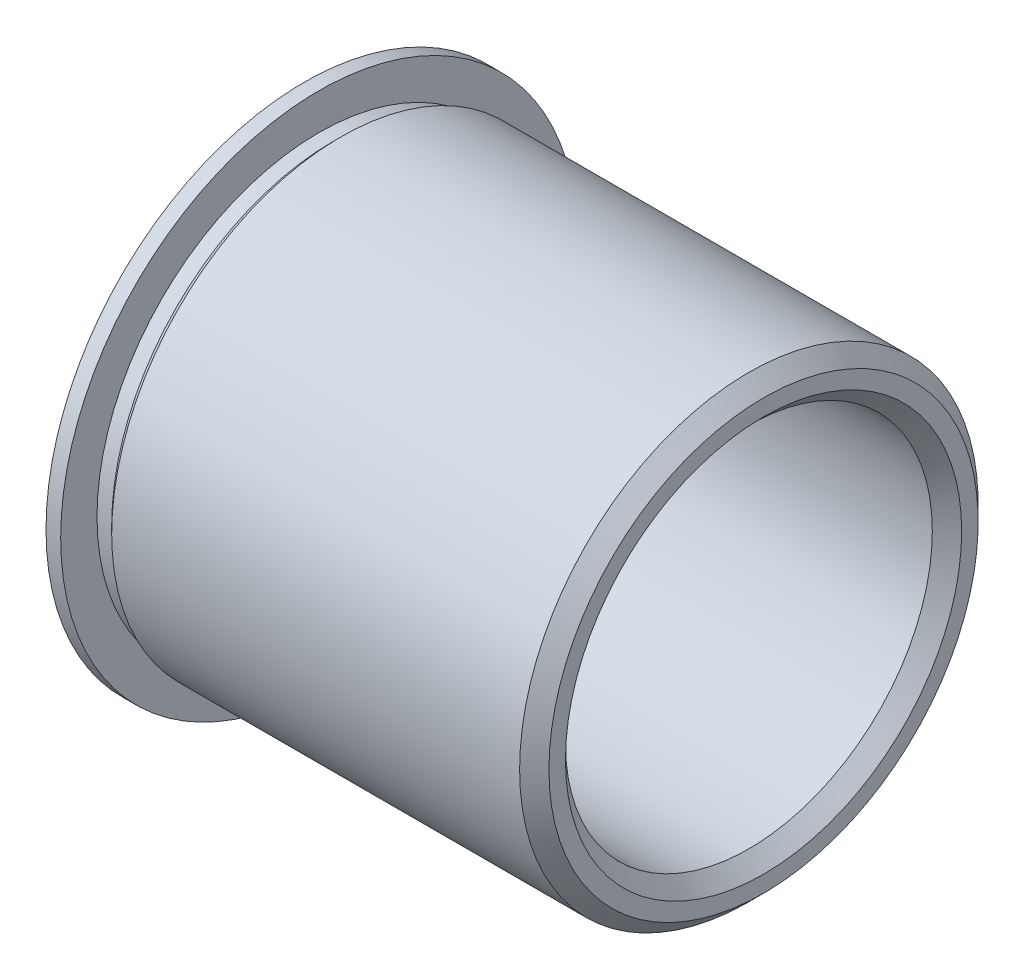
ISO-10303-21;
HEADER;
FILE_DESCRIPTION(('STEP AP214'),'2;1');
FILE_NAME('part.step','',(''),(''),'','','');
FILE_SCHEMA(('AUTOMOTIVE_DESIGN { 1 0 10303 214 1 1 1 1 }'));
ENDSEC;
DATA;
#1=APPLICATION_CONTEXT('core data for automotive mechanical design processes');
#2=APPLICATION_PROTOCOL_DEFINITION('international standard','automotive_design',2000,#1);
#3=PRODUCT_CONTEXT('',#1,'mechanical');
#4=PRODUCT('Part','Part','',(#3));
#5=PRODUCT_RELATED_PRODUCT_CATEGORY('part','',(#4));
#6=PRODUCT_DEFINITION_FORMATION('','',#4);
#7=PRODUCT_DEFINITION_CONTEXT('part definition',#1,'design');
#8=PRODUCT_DEFINITION('design','',#6,#7);
#9=PRODUCT_DEFINITION_SHAPE('','',#8);
#10=(LENGTH_UNIT() NAMED_UNIT(*) SI_UNIT(.MILLI.,.METRE.));
#11=(NAMED_UNIT(*) PLANE_ANGLE_UNIT() SI_UNIT($,.RADIAN.));
#12=(NAMED_UNIT(*) SI_UNIT($,.STERADIAN.) SOLID_ANGLE_UNIT());
#13=UNCERTAINTY_MEASURE_WITH_UNIT(LENGTH_MEASURE(1.E-05),#10,'distance_accuracy_value','');
#14=(GEOMETRIC_REPRESENTATION_CONTEXT(3) GLOBAL_UNCERTAINTY_ASSIGNED_CONTEXT((#13)) GLOBAL_UNIT_ASSIGNED_CONTEXT((#10,
#11,#12)) REPRESENTATION_CONTEXT('',''));
#15=CARTESIAN_POINT('',(0.,0.,0.));
#16=DIRECTION('',(0.,0.,1.));
#17=DIRECTION('',(1.,0.,0.));
#18=AXIS2_PLACEMENT_3D('',#15,#16,#17);
#19=CARTESIAN_POINT('',(-45.0910828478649,94.6526873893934,0.));
#20=DIRECTION('',(-1.,0.,0.));
#21=DIRECTION('',(0.,0.,1.));
#22=AXIS2_PLACEMENT_3D('',#19,#20,#21);
#23=PLANE('',#22);
#24=CARTESIAN_POINT('',(-45.0910828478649,94.6526873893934,0.));
#25=DIRECTION('',(-1.,0.,0.));
#26=DIRECTION('',(0.,0.,1.));
#27=AXIS2_PLACEMENT_3D('',#24,#25,#26);
#28=CIRCLE('',#27,3.429);
#29=CARTESIAN_POINT('',(-45.0910828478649,94.6526873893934,3.429));
#30=VERTEX_POINT('',#29);
#31=EDGE_CURVE('E10',#30,#30,#28,.T.);
#32=ORIENTED_EDGE('',*,*,#31,.T.);
#33=EDGE_LOOP('',(#32));
#34=FACE_BOUND('',#33,.T.);
#35=CARTESIAN_POINT('',(-45.0910828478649,94.6526873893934,0.));
#36=DIRECTION('',(-1.,0.,0.));
#37=DIRECTION('',(0.,0.,1.));
#38=AXIS2_PLACEMENT_3D('',#35,#36,#37);
#39=CIRCLE('',#38,3.71475);
#40=CARTESIAN_POINT('',(-45.0910828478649,94.6526873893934,3.71475));
#41=VERTEX_POINT('',#40);
#42=EDGE_CURVE('E52',#41,#41,#39,.T.);
#43=ORIENTED_EDGE('',*,*,#42,.F.);
#44=EDGE_LOOP('',(#43));
#45=FACE_BOUND('',#44,.T.);
#46=ADVANCED_FACE('F32',(#34,#45),#23,.F.);
#47=CARTESIAN_POINT('',(-45.0910828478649,94.6526873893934,0.));
#48=DIRECTION('',(-1.,0.,0.));
#49=DIRECTION('',(0.,0.,1.));
#50=AXIS2_PLACEMENT_3D('',#47,#48,#49);
#51=CONICAL_SURFACE('',#50,3.71475,0.785398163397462);
#52=CARTESIAN_POINT('',(-45.3450828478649,94.6526873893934,0.));
#53=DIRECTION('',(-1.,0.,0.));
#54=DIRECTION('',(0.,0.,1.));
#55=AXIS2_PLACEMENT_3D('',#52,#53,#54);
#56=CIRCLE('',#55,3.96875000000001);
#57=CARTESIAN_POINT('',(-45.3450828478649,94.6526873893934,3.96875000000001));
#58=VERTEX_POINT('',#57);
#59=EDGE_CURVE('E55',#58,#58,#56,.T.);
#60=ORIENTED_EDGE('',*,*,#59,.F.);
#61=EDGE_LOOP('',(#60));
#62=FACE_BOUND('',#61,.T.);
#63=ORIENTED_EDGE('',*,*,#42,.T.);
#64=EDGE_LOOP('',(#63));
#65=FACE_BOUND('',#64,.T.);
#66=ADVANCED_FACE('F103',(#62,#65),#51,.T.);
#67=CARTESIAN_POINT('',(-53.0412828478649,94.6526873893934,0.));
#68=DIRECTION('',(-1.,0.,0.));
#69=DIRECTION('',(0.,0.,1.));
#70=AXIS2_PLACEMENT_3D('',#67,#68,#69);
#71=CYLINDRICAL_SURFACE('',#70,3.96875000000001);
#72=CARTESIAN_POINT('',(-52.406282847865,94.6526873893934,0.));
#73=DIRECTION('',(-1.,0.,0.));
#74=DIRECTION('',(0.,0.,1.));
#75=AXIS2_PLACEMENT_3D('',#72,#73,#74);
#76=CIRCLE('',#75,3.96875000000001);
#77=CARTESIAN_POINT('',(-52.406282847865,94.6526873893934,3.96875000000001));
#78=VERTEX_POINT('',#77);
#79=EDGE_CURVE('E58',#78,#78,#76,.T.);
#80=ORIENTED_EDGE('',*,*,#79,.F.);
#81=EDGE_LOOP('',(#80));
#82=FACE_BOUND('',#81,.T.);
#83=ORIENTED_EDGE('',*,*,#59,.T.);
#84=EDGE_LOOP('',(#83));
#85=FACE_BOUND('',#84,.T.);
#86=ADVANCED_FACE('F97',(#82,#85),#71,.T.);
#87=CARTESIAN_POINT('',(-52.406282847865,94.6526873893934,0.));
#88=DIRECTION('',(1.,0.,0.));
#89=DIRECTION('',(0.,0.,-1.));
#90=AXIS2_PLACEMENT_3D('',#87,#88,#89);
#91=CONICAL_SURFACE('',#90,3.96875000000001,0.785398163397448);
#92=CARTESIAN_POINT('',(-52.533282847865,94.6526873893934,0.));
#93=DIRECTION('',(-1.,0.,0.));
#94=DIRECTION('',(0.,0.,1.));
#95=AXIS2_PLACEMENT_3D('',#92,#93,#94);
#96=CIRCLE('',#95,3.84175);
#97=CARTESIAN_POINT('',(-52.533282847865,94.6526873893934,3.84175));
#98=VERTEX_POINT('',#97);
#99=EDGE_CURVE('E61',#98,#98,#96,.T.);
#100=ORIENTED_EDGE('',*,*,#99,.F.);
#101=EDGE_LOOP('',(#100));
#102=FACE_BOUND('',#101,.T.);
#103=ORIENTED_EDGE('',*,*,#79,.T.);
#104=EDGE_LOOP('',(#103));
#105=FACE_BOUND('',#104,.T.);
#106=ADVANCED_FACE('F91',(#102,#105),#91,.T.);
#107=CARTESIAN_POINT('',(-53.0412828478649,94.6526873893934,0.));
#108=DIRECTION('',(-1.,0.,0.));
#109=DIRECTION('',(0.,0.,1.));
#110=AXIS2_PLACEMENT_3D('',#107,#108,#109);
#111=CYLINDRICAL_SURFACE('',#110,3.84175);
#112=CARTESIAN_POINT('',(-52.787282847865,94.6526873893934,0.));
#113=DIRECTION('',(-1.,0.,0.));
#114=DIRECTION('',(0.,0.,1.));
#115=AXIS2_PLACEMENT_3D('',#112,#113,#114);
#116=CIRCLE('',#115,3.84175);
#117=CARTESIAN_POINT('',(-52.787282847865,94.6526873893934,3.84175));
#118=VERTEX_POINT('',#117);
#119=EDGE_CURVE('E64',#118,#118,#116,.T.);
#120=ORIENTED_EDGE('',*,*,#119,.F.);
#121=EDGE_LOOP('',(#120));
#122=FACE_BOUND('',#121,.T.);
#123=ORIENTED_EDGE('',*,*,#99,.T.);
#124=EDGE_LOOP('',(#123));
#125=FACE_BOUND('',#124,.T.);
#126=ADVANCED_FACE('F85',(#122,#125),#111,.T.);
#127=CARTESIAN_POINT('',(-52.787282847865,98.4944373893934,0.));
#128=DIRECTION('',(-1.,0.,0.));
#129=DIRECTION('',(0.,0.,1.));
#130=AXIS2_PLACEMENT_3D('',#127,#128,#129);
#131=PLANE('',#130);
#132=CARTESIAN_POINT('',(-52.787282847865,94.6526873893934,0.));
#133=DIRECTION('',(-1.,0.,0.));
#134=DIRECTION('',(0.,0.,1.));
#135=AXIS2_PLACEMENT_3D('',#132,#133,#134);
#136=CIRCLE('',#135,4.47040000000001);
#137=CARTESIAN_POINT('',(-52.787282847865,94.6526873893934,4.47040000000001));
#138=VERTEX_POINT('',#137);
#139=EDGE_CURVE('E67',#138,#138,#136,.T.);
#140=ORIENTED_EDGE('',*,*,#139,.F.);
#141=EDGE_LOOP('',(#140));
#142=FACE_BOUND('',#141,.T.);
#143=ORIENTED_EDGE('',*,*,#119,.T.);
#144=EDGE_LOOP('',(#143));
#145=FACE_BOUND('',#144,.T.);
#146=ADVANCED_FACE('F79',(#142,#145),#131,.F.);
#147=CARTESIAN_POINT('',(-53.0412828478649,94.6526873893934,0.));
#148=DIRECTION('',(-1.,0.,0.));
#149=DIRECTION('',(0.,0.,1.));
#150=AXIS2_PLACEMENT_3D('',#147,#148,#149);
#151=CYLINDRICAL_SURFACE('',#150,4.47040000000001);
#152=CARTESIAN_POINT('',(-53.0412828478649,94.6526873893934,0.));
#153=DIRECTION('',(-1.,0.,0.));
#154=DIRECTION('',(0.,0.,1.));
#155=AXIS2_PLACEMENT_3D('',#152,#153,#154);
#156=CIRCLE('',#155,4.4704);
#157=CARTESIAN_POINT('',(-53.0412828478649,94.6526873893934,4.4704));
#158=VERTEX_POINT('',#157);
#159=EDGE_CURVE('E70',#158,#158,#156,.T.);
#160=ORIENTED_EDGE('',*,*,#159,.F.);
#161=EDGE_LOOP('',(#160));
#162=FACE_BOUND('',#161,.T.);
#163=ORIENTED_EDGE('',*,*,#139,.T.);
#164=EDGE_LOOP('',(#163));
#165=FACE_BOUND('',#164,.T.);
#166=ADVANCED_FACE('F76',(#162,#165),#151,.T.);
#167=CARTESIAN_POINT('',(-53.0412828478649,94.6526873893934,0.));
#168=DIRECTION('',(1.,0.,0.));
#169=DIRECTION('',(0.,0.,-1.));
#170=AXIS2_PLACEMENT_3D('',#167,#168,#169);
#171=PLANE('',#170);
#172=CARTESIAN_POINT('',(-53.0412828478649,94.6526873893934,0.));
#173=DIRECTION('',(1.,0.,0.));
#174=DIRECTION('',(0.,0.,-1.));
#175=AXIS2_PLACEMENT_3D('',#172,#173,#174);
#176=CIRCLE('',#175,3.429);
#177=CARTESIAN_POINT('',(-53.0412828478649,94.6526873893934,-3.429));
#178=VERTEX_POINT('',#177);
#179=EDGE_CURVE('E47',#178,#178,#176,.T.);
#180=ORIENTED_EDGE('',*,*,#179,.T.);
#181=EDGE_LOOP('',(#180));
#182=FACE_BOUND('',#181,.T.);
#183=ORIENTED_EDGE('',*,*,#159,.T.);
#184=EDGE_LOOP('',(#183));
#185=FACE_BOUND('',#184,.T.);
#186=ADVANCED_FACE('F74',(#182,#185),#171,.F.);
#187=CARTESIAN_POINT('',(-53.0412828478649,94.6526873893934,0.));
#188=DIRECTION('',(1.,0.,0.));
#189=DIRECTION('',(0.,0.,-1.));
#190=AXIS2_PLACEMENT_3D('',#187,#188,#189);
#191=CYLINDRICAL_SURFACE('',#190,3.175);
#192=CARTESIAN_POINT('',(-45.345082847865,94.6526873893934,0.));
#193=DIRECTION('',(-1.,0.,0.));
#194=DIRECTION('',(0.,0.,1.));
#195=AXIS2_PLACEMENT_3D('',#192,#193,#194);
#196=CIRCLE('',#195,3.175);
#197=CARTESIAN_POINT('',(-45.345082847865,94.6526873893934,3.175));
#198=VERTEX_POINT('',#197);
#199=EDGE_CURVE('E39',#198,#198,#196,.F.);
#200=ORIENTED_EDGE('',*,*,#199,.T.);
#201=EDGE_LOOP('',(#200));
#202=FACE_BOUND('',#201,.T.);
#203=CARTESIAN_POINT('',(-52.787282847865,94.6526873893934,0.));
#204=DIRECTION('',(1.,0.,0.));
#205=DIRECTION('',(0.,0.,-1.));
#206=AXIS2_PLACEMENT_3D('',#203,#204,#205);
#207=CIRCLE('',#206,3.175);
#208=CARTESIAN_POINT('',(-52.787282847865,94.6526873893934,-3.175));
#209=VERTEX_POINT('',#208);
#210=EDGE_CURVE('E43',#209,#209,#207,.F.);
#211=ORIENTED_EDGE('',*,*,#210,.T.);
#212=EDGE_LOOP('',(#211));
#213=FACE_BOUND('',#212,.T.);
#214=ADVANCED_FACE('F118',(#202,#213),#191,.F.);
#215=CARTESIAN_POINT('',(-53.0412828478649,94.6526873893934,0.));
#216=DIRECTION('',(-1.,0.,0.));
#217=DIRECTION('',(0.,0.,1.));
#218=AXIS2_PLACEMENT_3D('',#215,#216,#217);
#219=CONICAL_SURFACE('',#218,3.429,0.785398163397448);
#220=ORIENTED_EDGE('',*,*,#210,.F.);
#221=EDGE_LOOP('',(#220));
#222=FACE_BOUND('',#221,.T.);
#223=ORIENTED_EDGE('',*,*,#179,.F.);
#224=EDGE_LOOP('',(#223));
#225=FACE_BOUND('',#224,.T.);
#226=ADVANCED_FACE('F116',(#222,#225),#219,.F.);
#227=CARTESIAN_POINT('',(-45.345082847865,94.6526873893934,0.));
#228=DIRECTION('',(1.,0.,0.));
#229=DIRECTION('',(0.,0.,-1.));
#230=AXIS2_PLACEMENT_3D('',#227,#228,#229);
#231=CONICAL_SURFACE('',#230,3.175,0.785398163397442);
#232=ORIENTED_EDGE('',*,*,#31,.F.);
#233=EDGE_LOOP('',(#232));
#234=FACE_BOUND('',#233,.T.);
#235=ORIENTED_EDGE('',*,*,#199,.F.);
#236=EDGE_LOOP('',(#235));
#237=FACE_BOUND('',#236,.T.);
#238=ADVANCED_FACE('F34',(#234,#237),#231,.F.);
#239=CLOSED_SHELL('',(#46,#66,#86,#106,#126,#146,#166,#186,#214,#226,#238));
#240=MANIFOLD_SOLID_BREP('B2',#239);
#241=ADVANCED_BREP_SHAPE_REPRESENTATION('',(#18,#240),#14);
#242=SHAPE_DEFINITION_REPRESENTATION(#9,#241);
ENDSEC;
END-ISO-10303-21;
